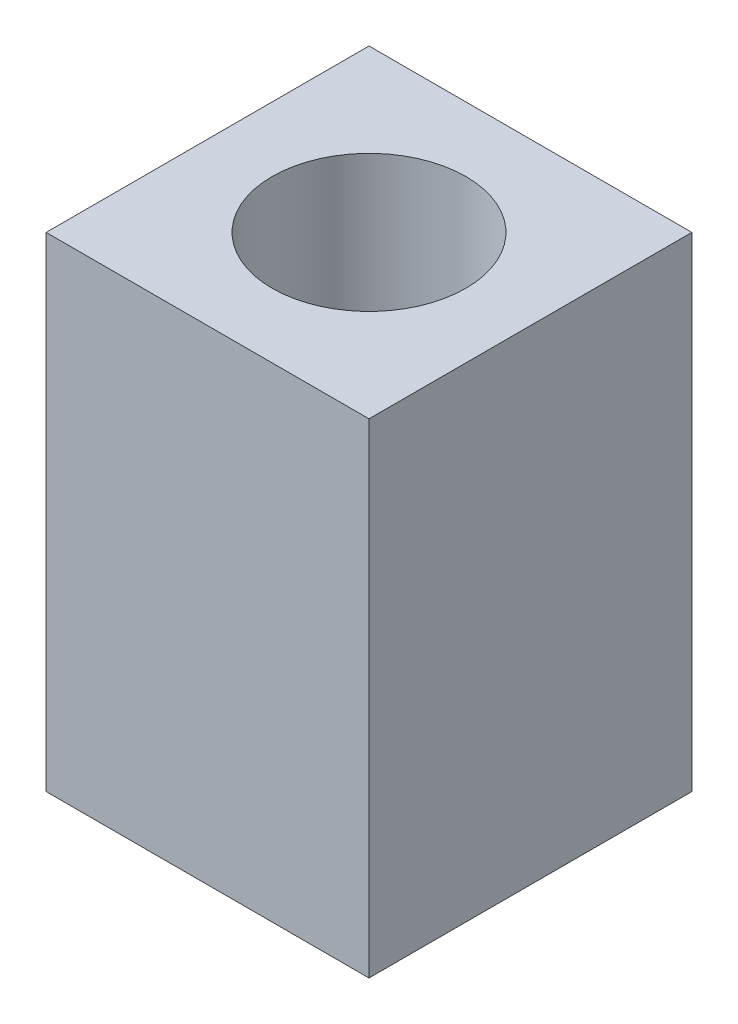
ISO-10303-21;
HEADER;
FILE_DESCRIPTION(('STEP AP214'),'2;1');
FILE_NAME('part.step','',(''),(''),'','','');
FILE_SCHEMA(('AUTOMOTIVE_DESIGN { 1 0 10303 214 1 1 1 1 }'));
ENDSEC;
DATA;
#1=APPLICATION_CONTEXT('core data for automotive mechanical design processes');
#2=APPLICATION_PROTOCOL_DEFINITION('international standard','automotive_design',2000,#1);
#3=PRODUCT_CONTEXT('',#1,'mechanical');
#4=PRODUCT('Part','Part','',(#3));
#5=PRODUCT_RELATED_PRODUCT_CATEGORY('part','',(#4));
#6=PRODUCT_DEFINITION_FORMATION('','',#4);
#7=PRODUCT_DEFINITION_CONTEXT('part definition',#1,'design');
#8=PRODUCT_DEFINITION('design','',#6,#7);
#9=PRODUCT_DEFINITION_SHAPE('','',#8);
#10=(LENGTH_UNIT() NAMED_UNIT(*) SI_UNIT(.MILLI.,.METRE.));
#11=(NAMED_UNIT(*) PLANE_ANGLE_UNIT() SI_UNIT($,.RADIAN.));
#12=(NAMED_UNIT(*) SI_UNIT($,.STERADIAN.) SOLID_ANGLE_UNIT());
#13=UNCERTAINTY_MEASURE_WITH_UNIT(LENGTH_MEASURE(1.E-05),#10,'distance_accuracy_value','');
#14=(GEOMETRIC_REPRESENTATION_CONTEXT(3) GLOBAL_UNCERTAINTY_ASSIGNED_CONTEXT((#13)) GLOBAL_UNIT_ASSIGNED_CONTEXT((#10,
#11,#12)) REPRESENTATION_CONTEXT('',''));
#15=CARTESIAN_POINT('',(0.,0.,0.));
#16=DIRECTION('',(0.,0.,1.));
#17=DIRECTION('',(1.,0.,0.));
#18=AXIS2_PLACEMENT_3D('',#15,#16,#17);
#19=CARTESIAN_POINT('',(-50.,85.,100.));
#20=DIRECTION('',(1.,0.,0.));
#21=DIRECTION('',(0.,1.,0.));
#22=AXIS2_PLACEMENT_3D('',#19,#20,#21);
#23=PLANE('',#22);
#24=DIRECTION('',(0.,-1.,0.));
#25=VECTOR('',#24,1.);
#26=CARTESIAN_POINT('',(-50.,85.,0.));
#27=LINE('',#26,#25);
#28=CARTESIAN_POINT('',(-50.,85.,0.));
#29=VERTEX_POINT('',#28);
#30=CARTESIAN_POINT('',(-50.,-65.,0.));
#31=VERTEX_POINT('',#30);
#32=EDGE_CURVE('E90',#29,#31,#27,.T.);
#33=ORIENTED_EDGE('',*,*,#32,.T.);
#34=DIRECTION('',(0.,0.,-1.));
#35=VECTOR('',#34,1.);
#36=CARTESIAN_POINT('',(-50.,-65.,100.));
#37=LINE('',#36,#35);
#38=CARTESIAN_POINT('',(-50.,-65.,100.));
#39=VERTEX_POINT('',#38);
#40=EDGE_CURVE('E13',#39,#31,#37,.T.);
#41=ORIENTED_EDGE('',*,*,#40,.F.);
#42=DIRECTION('',(0.,-1.,0.));
#43=VECTOR('',#42,1.);
#44=CARTESIAN_POINT('',(-50.,85.,100.));
#45=LINE('',#44,#43);
#46=CARTESIAN_POINT('',(-50.,85.,100.));
#47=VERTEX_POINT('',#46);
#48=EDGE_CURVE('E113',#47,#39,#45,.T.);
#49=ORIENTED_EDGE('',*,*,#48,.F.);
#50=DIRECTION('',(0.,0.,-1.));
#51=VECTOR('',#50,1.);
#52=CARTESIAN_POINT('',(-50.,85.,100.));
#53=LINE('',#52,#51);
#54=EDGE_CURVE('E102',#47,#29,#53,.T.);
#55=ORIENTED_EDGE('',*,*,#54,.T.);
#56=EDGE_LOOP('',(#33,#41,#49,#55));
#57=FACE_BOUND('',#56,.T.);
#58=ADVANCED_FACE('F45',(#57),#23,.F.);
#59=CARTESIAN_POINT('',(-50.,-65.,100.));
#60=DIRECTION('',(0.,1.,0.));
#61=DIRECTION('',(0.,0.,1.));
#62=AXIS2_PLACEMENT_3D('',#59,#60,#61);
#63=PLANE('',#62);
#64=DIRECTION('',(1.,0.,0.));
#65=VECTOR('',#64,1.);
#66=CARTESIAN_POINT('',(-50.,-65.,0.));
#67=LINE('',#66,#65);
#68=CARTESIAN_POINT('',(50.,-65.,0.));
#69=VERTEX_POINT('',#68);
#70=EDGE_CURVE('E86',#31,#69,#67,.T.);
#71=ORIENTED_EDGE('',*,*,#70,.T.);
#72=DIRECTION('',(0.,0.,-1.));
#73=VECTOR('',#72,1.);
#74=CARTESIAN_POINT('',(50.,-65.,100.));
#75=LINE('',#74,#73);
#76=CARTESIAN_POINT('',(50.,-65.,100.));
#77=VERTEX_POINT('',#76);
#78=EDGE_CURVE('E53',#77,#69,#75,.T.);
#79=ORIENTED_EDGE('',*,*,#78,.F.);
#80=DIRECTION('',(1.,0.,0.));
#81=VECTOR('',#80,1.);
#82=CARTESIAN_POINT('',(-50.,-65.,100.));
#83=LINE('',#82,#81);
#84=EDGE_CURVE('E98',#39,#77,#83,.T.);
#85=ORIENTED_EDGE('',*,*,#84,.F.);
#86=ORIENTED_EDGE('',*,*,#40,.T.);
#87=EDGE_LOOP('',(#71,#79,#85,#86));
#88=FACE_BOUND('',#87,.T.);
#89=ADVANCED_FACE('F97',(#88),#63,.F.);
#90=CARTESIAN_POINT('',(50.,85.,100.));
#91=DIRECTION('',(-1.,0.,0.));
#92=DIRECTION('',(0.,-1.,0.));
#93=AXIS2_PLACEMENT_3D('',#90,#91,#92);
#94=PLANE('',#93);
#95=DIRECTION('',(0.,1.,0.));
#96=VECTOR('',#95,1.);
#97=CARTESIAN_POINT('',(50.,85.,0.));
#98=LINE('',#97,#96);
#99=CARTESIAN_POINT('',(50.,85.,0.));
#100=VERTEX_POINT('',#99);
#101=EDGE_CURVE('E91',#69,#100,#98,.T.);
#102=ORIENTED_EDGE('',*,*,#101,.T.);
#103=DIRECTION('',(0.,0.,-1.));
#104=VECTOR('',#103,1.);
#105=CARTESIAN_POINT('',(50.,85.,100.));
#106=LINE('',#105,#104);
#107=CARTESIAN_POINT('',(50.,85.,100.));
#108=VERTEX_POINT('',#107);
#109=EDGE_CURVE('E119',#108,#100,#106,.T.);
#110=ORIENTED_EDGE('',*,*,#109,.F.);
#111=DIRECTION('',(0.,1.,0.));
#112=VECTOR('',#111,1.);
#113=CARTESIAN_POINT('',(50.,85.,100.));
#114=LINE('',#113,#112);
#115=EDGE_CURVE('E65',#77,#108,#114,.T.);
#116=ORIENTED_EDGE('',*,*,#115,.F.);
#117=ORIENTED_EDGE('',*,*,#78,.T.);
#118=EDGE_LOOP('',(#102,#110,#116,#117));
#119=FACE_BOUND('',#118,.T.);
#120=ADVANCED_FACE('F123',(#119),#94,.F.);
#121=CARTESIAN_POINT('',(-50.,85.,100.));
#122=DIRECTION('',(0.,-1.,0.));
#123=DIRECTION('',(0.,0.,-1.));
#124=AXIS2_PLACEMENT_3D('',#121,#122,#123);
#125=PLANE('',#124);
#126=CARTESIAN_POINT('',(0.,85.,50.));
#127=DIRECTION('',(0.,1.,0.));
#128=DIRECTION('',(0.,0.,1.));
#129=AXIS2_PLACEMENT_3D('',#126,#127,#128);
#130=CIRCLE('',#129,30.);
#131=CARTESIAN_POINT('',(0.,85.,80.));
#132=VERTEX_POINT('',#131);
#133=EDGE_CURVE('E106',#132,#132,#130,.T.);
#134=ORIENTED_EDGE('',*,*,#133,.F.);
#135=EDGE_LOOP('',(#134));
#136=FACE_BOUND('',#135,.T.);
#137=DIRECTION('',(-1.,0.,0.));
#138=VECTOR('',#137,1.);
#139=CARTESIAN_POINT('',(-50.,85.,0.));
#140=LINE('',#139,#138);
#141=EDGE_CURVE('E111',#100,#29,#140,.T.);
#142=ORIENTED_EDGE('',*,*,#141,.T.);
#143=ORIENTED_EDGE('',*,*,#54,.F.);
#144=DIRECTION('',(-1.,0.,0.));
#145=VECTOR('',#144,1.);
#146=CARTESIAN_POINT('',(-50.,85.,100.));
#147=LINE('',#146,#145);
#148=EDGE_CURVE('E60',#108,#47,#147,.T.);
#149=ORIENTED_EDGE('',*,*,#148,.F.);
#150=ORIENTED_EDGE('',*,*,#109,.T.);
#151=EDGE_LOOP('',(#142,#143,#149,#150));
#152=FACE_BOUND('',#151,.T.);
#153=ADVANCED_FACE('F125',(#136,#152),#125,.F.);
#154=CARTESIAN_POINT('',(-50.,-65.,100.));
#155=DIRECTION('',(0.,0.,1.));
#156=DIRECTION('',(1.,0.,0.));
#157=AXIS2_PLACEMENT_3D('',#154,#155,#156);
#158=PLANE('',#157);
#159=ORIENTED_EDGE('',*,*,#48,.T.);
#160=ORIENTED_EDGE('',*,*,#84,.T.);
#161=ORIENTED_EDGE('',*,*,#115,.T.);
#162=ORIENTED_EDGE('',*,*,#148,.T.);
#163=EDGE_LOOP('',(#159,#160,#161,#162));
#164=FACE_BOUND('',#163,.T.);
#165=ADVANCED_FACE('F126',(#164),#158,.T.);
#166=CARTESIAN_POINT('',(-50.,-65.,0.));
#167=DIRECTION('',(0.,0.,1.));
#168=DIRECTION('',(1.,0.,0.));
#169=AXIS2_PLACEMENT_3D('',#166,#167,#168);
#170=PLANE('',#169);
#171=ORIENTED_EDGE('',*,*,#32,.F.);
#172=ORIENTED_EDGE('',*,*,#141,.F.);
#173=ORIENTED_EDGE('',*,*,#101,.F.);
#174=ORIENTED_EDGE('',*,*,#70,.F.);
#175=EDGE_LOOP('',(#171,#172,#173,#174));
#176=FACE_BOUND('',#175,.T.);
#177=ADVANCED_FACE('F87',(#176),#170,.F.);
#178=CARTESIAN_POINT('',(0.,-15.,50.));
#179=DIRECTION('',(0.,1.,0.));
#180=DIRECTION('',(0.,0.,1.));
#181=AXIS2_PLACEMENT_3D('',#178,#179,#180);
#182=CYLINDRICAL_SURFACE('',#181,30.);
#183=CARTESIAN_POINT('',(0.,-15.,50.));
#184=DIRECTION('',(0.,1.,0.));
#185=DIRECTION('',(0.,0.,1.));
#186=AXIS2_PLACEMENT_3D('',#183,#184,#185);
#187=CIRCLE('',#186,30.);
#188=CARTESIAN_POINT('',(0.,-15.,80.));
#189=VERTEX_POINT('',#188);
#190=EDGE_CURVE('E103',#189,#189,#187,.T.);
#191=ORIENTED_EDGE('',*,*,#190,.F.);
#192=EDGE_LOOP('',(#191));
#193=FACE_BOUND('',#192,.T.);
#194=ORIENTED_EDGE('',*,*,#133,.T.);
#195=EDGE_LOOP('',(#194));
#196=FACE_BOUND('',#195,.T.);
#197=ADVANCED_FACE('F133',(#193,#196),#182,.F.);
#198=CARTESIAN_POINT('',(0.,-15.,50.));
#199=DIRECTION('',(0.,1.,0.));
#200=DIRECTION('',(0.,0.,1.));
#201=AXIS2_PLACEMENT_3D('',#198,#199,#200);
#202=PLANE('',#201);
#203=CARTESIAN_POINT('',(0.,-15.,50.));
#204=DIRECTION('',(0.,1.,0.));
#205=DIRECTION('',(0.,0.,1.));
#206=AXIS2_PLACEMENT_3D('',#203,#204,#205);
#207=CIRCLE('',#206,22.);
#208=CARTESIAN_POINT('',(0.,-15.,72.));
#209=VERTEX_POINT('',#208);
#210=EDGE_CURVE('E233',#209,#209,#207,.T.);
#211=ORIENTED_EDGE('',*,*,#210,.F.);
#212=EDGE_LOOP('',(#211));
#213=FACE_BOUND('',#212,.T.);
#214=ORIENTED_EDGE('',*,*,#190,.T.);
#215=EDGE_LOOP('',(#214));
#216=FACE_BOUND('',#215,.T.);
#217=ADVANCED_FACE('F164',(#213,#216),#202,.T.);
#218=CARTESIAN_POINT('',(0.,-15.,50.));
#219=DIRECTION('',(0.,1.,0.));
#220=DIRECTION('',(0.,0.,1.));
#221=AXIS2_PLACEMENT_3D('',#218,#219,#220);
#222=CONICAL_SURFACE('',#221,22.,0.0872664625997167);
#223=ORIENTED_EDGE('',*,*,#210,.T.);
#224=EDGE_LOOP('',(#223));
#225=FACE_BOUND('',#224,.T.);
#226=CARTESIAN_POINT('',(0.,-46.5435778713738,50.));
#227=DIRECTION('',(0.,1.,0.));
#228=DIRECTION('',(-1.,0.,0.));
#229=AXIS2_PLACEMENT_3D('',#226,#227,#228);
#230=CIRCLE('',#229,19.2402945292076);
#231=CARTESIAN_POINT('',(-19.2402945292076,-46.5435778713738,50.));
#232=VERTEX_POINT('',#231);
#233=EDGE_CURVE('E249',#232,#232,#230,.T.);
#234=ORIENTED_EDGE('',*,*,#233,.F.);
#235=EDGE_LOOP('',(#234));
#236=FACE_BOUND('',#235,.T.);
#237=ADVANCED_FACE('F172',(#225,#236),#222,.F.);
#238=CARTESIAN_POINT('',(0.,-46.5435778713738,50.));
#239=DIRECTION('',(0.,-1.,0.));
#240=DIRECTION('',(1.,0.,0.));
#241=AXIS2_PLACEMENT_3D('',#238,#239,#240);
#242=CONICAL_SURFACE('',#241,15.2440998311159,0.0872664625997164);
#243=CARTESIAN_POINT('',(0.,-45.,50.));
#244=DIRECTION('',(0.,1.,0.));
#245=DIRECTION('',(0.,0.,1.));
#246=AXIS2_PLACEMENT_3D('',#243,#244,#245);
#247=CIRCLE('',#246,15.1090542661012);
#248=CARTESIAN_POINT('',(0.,-45.,65.1090542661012));
#249=VERTEX_POINT('',#248);
#250=EDGE_CURVE('E48',#249,#249,#247,.F.);
#251=ORIENTED_EDGE('',*,*,#250,.T.);
#252=EDGE_LOOP('',(#251));
#253=FACE_BOUND('',#252,.T.);
#254=CARTESIAN_POINT('',(0.,-46.5435778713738,50.));
#255=DIRECTION('',(0.,1.,0.));
#256=DIRECTION('',(-1.,0.,0.));
#257=AXIS2_PLACEMENT_3D('',#254,#255,#256);
#258=CIRCLE('',#257,15.2440998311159);
#259=CARTESIAN_POINT('',(-15.2440998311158,-46.5435778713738,50.));
#260=VERTEX_POINT('',#259);
#261=EDGE_CURVE('E230',#260,#260,#258,.T.);
#262=ORIENTED_EDGE('',*,*,#261,.T.);
#263=EDGE_LOOP('',(#262));
#264=FACE_BOUND('',#263,.T.);
#265=ADVANCED_FACE('F181',(#253,#264),#242,.T.);
#266=CARTESIAN_POINT('',(0.,-46.5,50.));
#267=DIRECTION('',(0.,1.,0.));
#268=DIRECTION('',(-1.,0.,0.));
#269=AXIS2_PLACEMENT_3D('',#266,#267,#268);
#270=TOROIDAL_SURFACE('',#269,15.7421971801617,0.5);
#271=ORIENTED_EDGE('',*,*,#261,.F.);
#272=EDGE_LOOP('',(#271));
#273=FACE_BOUND('',#272,.T.);
#274=CARTESIAN_POINT('',(0.,-47.,50.));
#275=DIRECTION('',(0.,1.,0.));
#276=DIRECTION('',(-1.,0.,0.));
#277=AXIS2_PLACEMENT_3D('',#274,#275,#276);
#278=CIRCLE('',#277,15.7421971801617);
#279=CARTESIAN_POINT('',(-15.7421971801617,-47.,50.));
#280=VERTEX_POINT('',#279);
#281=EDGE_CURVE('E231',#280,#280,#278,.T.);
#282=ORIENTED_EDGE('',*,*,#281,.T.);
#283=EDGE_LOOP('',(#282));
#284=FACE_BOUND('',#283,.T.);
#285=ADVANCED_FACE('F207',(#273,#284),#270,.F.);
#286=CARTESIAN_POINT('',(-18.7421971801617,-47.,50.));
#287=DIRECTION('',(0.,-1.,0.));
#288=DIRECTION('',(1.,0.,0.));
#289=AXIS2_PLACEMENT_3D('',#286,#287,#288);
#290=PLANE('',#289);
#291=ORIENTED_EDGE('',*,*,#281,.F.);
#292=EDGE_LOOP('',(#291));
#293=FACE_BOUND('',#292,.T.);
#294=CARTESIAN_POINT('',(0.,-47.,50.));
#295=DIRECTION('',(0.,1.,0.));
#296=DIRECTION('',(-1.,0.,0.));
#297=AXIS2_PLACEMENT_3D('',#294,#295,#296);
#298=CIRCLE('',#297,18.7421971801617);
#299=CARTESIAN_POINT('',(-18.7421971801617,-47.,50.));
#300=VERTEX_POINT('',#299);
#301=EDGE_CURVE('E235',#300,#300,#298,.T.);
#302=ORIENTED_EDGE('',*,*,#301,.T.);
#303=EDGE_LOOP('',(#302));
#304=FACE_BOUND('',#303,.T.);
#305=ADVANCED_FACE('F199',(#293,#304),#290,.F.);
#306=CARTESIAN_POINT('',(0.,-46.5,50.));
#307=DIRECTION('',(0.,1.,0.));
#308=DIRECTION('',(-1.,0.,0.));
#309=AXIS2_PLACEMENT_3D('',#306,#307,#308);
#310=TOROIDAL_SURFACE('',#309,18.7421971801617,0.5);
#311=ORIENTED_EDGE('',*,*,#301,.F.);
#312=EDGE_LOOP('',(#311));
#313=FACE_BOUND('',#312,.T.);
#314=ORIENTED_EDGE('',*,*,#233,.T.);
#315=EDGE_LOOP('',(#314));
#316=FACE_BOUND('',#315,.T.);
#317=ADVANCED_FACE('F191',(#313,#316),#310,.F.);
#318=CARTESIAN_POINT('',(0.,-45.,50.));
#319=DIRECTION('',(0.,1.,0.));
#320=DIRECTION('',(0.,0.,1.));
#321=AXIS2_PLACEMENT_3D('',#318,#319,#320);
#322=PLANE('',#321);
#323=ORIENTED_EDGE('',*,*,#250,.F.);
#324=EDGE_LOOP('',(#323));
#325=FACE_BOUND('',#324,.T.);
#326=ADVANCED_FACE('F187',(#325),#322,.T.);
#327=CLOSED_SHELL('',(#58,#89,#120,#153,#165,#177,#197,#217,#237,#265,#285,#305,#317,#326));
#328=MANIFOLD_SOLID_BREP('B2',#327);
#329=ADVANCED_BREP_SHAPE_REPRESENTATION('',(#18,#328),#14);
#330=SHAPE_DEFINITION_REPRESENTATION(#9,#329);
ENDSEC;
END-ISO-10303-21;
